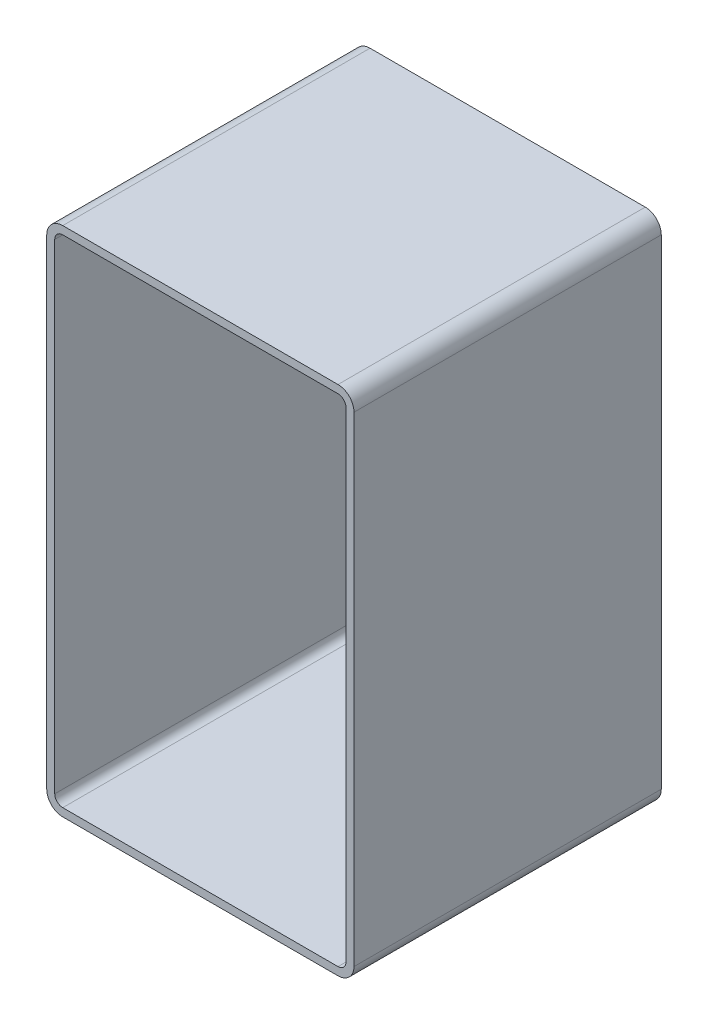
ISO-10303-21;
HEADER;
FILE_DESCRIPTION(('STEP AP214'),'2;1');
FILE_NAME('part.step','',(''),(''),'','','');
FILE_SCHEMA(('AUTOMOTIVE_DESIGN { 1 0 10303 214 1 1 1 1 }'));
ENDSEC;
DATA;
#1=APPLICATION_CONTEXT('core data for automotive mechanical design processes');
#2=APPLICATION_PROTOCOL_DEFINITION('international standard','automotive_design',2000,#1);
#3=PRODUCT_CONTEXT('',#1,'mechanical');
#4=PRODUCT('Part','Part','',(#3));
#5=PRODUCT_RELATED_PRODUCT_CATEGORY('part','',(#4));
#6=PRODUCT_DEFINITION_FORMATION('','',#4);
#7=PRODUCT_DEFINITION_CONTEXT('part definition',#1,'design');
#8=PRODUCT_DEFINITION('design','',#6,#7);
#9=PRODUCT_DEFINITION_SHAPE('','',#8);
#10=(LENGTH_UNIT() NAMED_UNIT(*) SI_UNIT(.MILLI.,.METRE.));
#11=(NAMED_UNIT(*) PLANE_ANGLE_UNIT() SI_UNIT($,.RADIAN.));
#12=(NAMED_UNIT(*) SI_UNIT($,.STERADIAN.) SOLID_ANGLE_UNIT());
#13=UNCERTAINTY_MEASURE_WITH_UNIT(LENGTH_MEASURE(1.E-05),#10,'distance_accuracy_value','');
#14=(GEOMETRIC_REPRESENTATION_CONTEXT(3) GLOBAL_UNCERTAINTY_ASSIGNED_CONTEXT((#13)) GLOBAL_UNIT_ASSIGNED_CONTEXT((#10,
#11,#12)) REPRESENTATION_CONTEXT('',''));
#15=CARTESIAN_POINT('',(0.,0.,0.));
#16=DIRECTION('',(0.,0.,1.));
#17=DIRECTION('',(1.,0.,0.));
#18=AXIS2_PLACEMENT_3D('',#15,#16,#17);
#19=CARTESIAN_POINT('',(16.9817030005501,493.816228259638,304.8));
#20=DIRECTION('',(0.,0.,1.));
#21=DIRECTION('',(1.,0.,0.));
#22=AXIS2_PLACEMENT_3D('',#19,#20,#21);
#23=PLANE('',#22);
#24=CARTESIAN_POINT('',(16.9817030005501,493.816228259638,304.8));
#25=DIRECTION('',(0.,0.,1.));
#26=DIRECTION('',(1.,0.,0.));
#27=AXIS2_PLACEMENT_3D('',#24,#25,#26);
#28=CIRCLE('',#27,15.875);
#29=CARTESIAN_POINT('',(16.9817030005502,509.691228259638,304.8));
#30=VERTEX_POINT('',#29);
#31=CARTESIAN_POINT('',(1.10670300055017,493.816228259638,304.8));
#32=VERTEX_POINT('',#31);
#33=EDGE_CURVE('E211',#30,#32,#28,.T.);
#34=ORIENTED_EDGE('',*,*,#33,.T.);
#35=DIRECTION('',(0.,-1.,0.));
#36=VECTOR('',#35,1.);
#37=CARTESIAN_POINT('',(1.10670300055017,17.5662282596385,304.8));
#38=LINE('',#37,#36);
#39=CARTESIAN_POINT('',(1.10670300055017,17.5662282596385,304.8));
#40=VERTEX_POINT('',#39);
#41=EDGE_CURVE('E214',#32,#40,#38,.T.);
#42=ORIENTED_EDGE('',*,*,#41,.T.);
#43=CARTESIAN_POINT('',(16.9817030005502,17.5662282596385,304.8));
#44=DIRECTION('',(0.,0.,1.));
#45=DIRECTION('',(1.,0.,0.));
#46=AXIS2_PLACEMENT_3D('',#43,#44,#45);
#47=CIRCLE('',#46,15.875);
#48=CARTESIAN_POINT('',(16.9817030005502,1.6912282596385,304.8));
#49=VERTEX_POINT('',#48);
#50=EDGE_CURVE('E217',#40,#49,#47,.T.);
#51=ORIENTED_EDGE('',*,*,#50,.T.);
#52=DIRECTION('',(1.,0.,0.));
#53=VECTOR('',#52,1.);
#54=CARTESIAN_POINT('',(290.03170300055,1.6912282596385,304.8));
#55=LINE('',#54,#53);
#56=CARTESIAN_POINT('',(290.03170300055,1.69122825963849,304.8));
#57=VERTEX_POINT('',#56);
#58=EDGE_CURVE('E219',#49,#57,#55,.T.);
#59=ORIENTED_EDGE('',*,*,#58,.T.);
#60=CARTESIAN_POINT('',(290.03170300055,17.5662282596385,304.8));
#61=DIRECTION('',(0.,0.,1.));
#62=DIRECTION('',(1.,0.,0.));
#63=AXIS2_PLACEMENT_3D('',#60,#61,#62);
#64=CIRCLE('',#63,15.875);
#65=CARTESIAN_POINT('',(305.90670300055,17.5662282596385,304.8));
#66=VERTEX_POINT('',#65);
#67=EDGE_CURVE('E221',#57,#66,#64,.T.);
#68=ORIENTED_EDGE('',*,*,#67,.T.);
#69=DIRECTION('',(0.,1.,0.));
#70=VECTOR('',#69,1.);
#71=CARTESIAN_POINT('',(305.90670300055,493.816228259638,304.8));
#72=LINE('',#71,#70);
#73=CARTESIAN_POINT('',(305.90670300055,493.816228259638,304.8));
#74=VERTEX_POINT('',#73);
#75=EDGE_CURVE('E223',#66,#74,#72,.T.);
#76=ORIENTED_EDGE('',*,*,#75,.T.);
#77=CARTESIAN_POINT('',(290.03170300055,493.816228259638,304.8));
#78=DIRECTION('',(0.,0.,1.));
#79=DIRECTION('',(1.,0.,0.));
#80=AXIS2_PLACEMENT_3D('',#77,#78,#79);
#81=CIRCLE('',#80,15.875);
#82=CARTESIAN_POINT('',(290.03170300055,509.691228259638,304.8));
#83=VERTEX_POINT('',#82);
#84=EDGE_CURVE('E225',#74,#83,#81,.T.);
#85=ORIENTED_EDGE('',*,*,#84,.T.);
#86=DIRECTION('',(-1.,0.,0.));
#87=VECTOR('',#86,1.);
#88=CARTESIAN_POINT('',(16.9817030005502,509.691228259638,304.8));
#89=LINE('',#88,#87);
#90=EDGE_CURVE('E227',#83,#30,#89,.T.);
#91=ORIENTED_EDGE('',*,*,#90,.T.);
#92=EDGE_LOOP('',(#34,#42,#51,#59,#68,#76,#85,#91));
#93=FACE_BOUND('',#92,.T.);
#94=DIRECTION('',(0.,-1.,0.));
#95=VECTOR('',#94,1.);
#96=CARTESIAN_POINT('',(9.04420300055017,17.5662282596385,304.8));
#97=LINE('',#96,#95);
#98=CARTESIAN_POINT('',(9.04420300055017,493.816228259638,304.8));
#99=VERTEX_POINT('',#98);
#100=CARTESIAN_POINT('',(9.04420300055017,17.5662282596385,304.8));
#101=VERTEX_POINT('',#100);
#102=EDGE_CURVE('E154',#99,#101,#97,.T.);
#103=ORIENTED_EDGE('',*,*,#102,.F.);
#104=CARTESIAN_POINT('',(16.9817030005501,493.816228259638,304.8));
#105=DIRECTION('',(0.,0.,1.));
#106=DIRECTION('',(1.,0.,0.));
#107=AXIS2_PLACEMENT_3D('',#104,#105,#106);
#108=CIRCLE('',#107,7.93750000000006);
#109=CARTESIAN_POINT('',(16.9817030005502,501.753728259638,304.8));
#110=VERTEX_POINT('',#109);
#111=EDGE_CURVE('E146',#110,#99,#108,.T.);
#112=ORIENTED_EDGE('',*,*,#111,.F.);
#113=DIRECTION('',(-1.,0.,0.));
#114=VECTOR('',#113,1.);
#115=CARTESIAN_POINT('',(16.9817030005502,501.753728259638,304.8));
#116=LINE('',#115,#114);
#117=CARTESIAN_POINT('',(290.03170300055,501.753728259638,304.8));
#118=VERTEX_POINT('',#117);
#119=EDGE_CURVE('E179',#118,#110,#116,.T.);
#120=ORIENTED_EDGE('',*,*,#119,.F.);
#121=CARTESIAN_POINT('',(290.03170300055,493.816228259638,304.8));
#122=DIRECTION('',(0.,0.,1.));
#123=DIRECTION('',(1.,0.,0.));
#124=AXIS2_PLACEMENT_3D('',#121,#122,#123);
#125=CIRCLE('',#124,7.93750000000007);
#126=CARTESIAN_POINT('',(297.96920300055,493.816228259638,304.8));
#127=VERTEX_POINT('',#126);
#128=EDGE_CURVE('E177',#127,#118,#125,.T.);
#129=ORIENTED_EDGE('',*,*,#128,.F.);
#130=DIRECTION('',(0.,1.,0.));
#131=VECTOR('',#130,1.);
#132=CARTESIAN_POINT('',(297.96920300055,493.816228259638,304.8));
#133=LINE('',#132,#131);
#134=CARTESIAN_POINT('',(297.96920300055,17.5662282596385,304.8));
#135=VERTEX_POINT('',#134);
#136=EDGE_CURVE('E175',#135,#127,#133,.T.);
#137=ORIENTED_EDGE('',*,*,#136,.F.);
#138=CARTESIAN_POINT('',(290.03170300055,17.5662282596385,304.8));
#139=DIRECTION('',(0.,0.,1.));
#140=DIRECTION('',(1.,0.,0.));
#141=AXIS2_PLACEMENT_3D('',#138,#139,#140);
#142=CIRCLE('',#141,7.93750000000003);
#143=CARTESIAN_POINT('',(290.03170300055,9.62872825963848,304.8));
#144=VERTEX_POINT('',#143);
#145=EDGE_CURVE('E173',#144,#135,#142,.T.);
#146=ORIENTED_EDGE('',*,*,#145,.F.);
#147=DIRECTION('',(1.,0.,0.));
#148=VECTOR('',#147,1.);
#149=CARTESIAN_POINT('',(290.03170300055,9.6287282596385,304.8));
#150=LINE('',#149,#148);
#151=CARTESIAN_POINT('',(16.9817030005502,9.6287282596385,304.8));
#152=VERTEX_POINT('',#151);
#153=EDGE_CURVE('E169',#152,#144,#150,.T.);
#154=ORIENTED_EDGE('',*,*,#153,.F.);
#155=CARTESIAN_POINT('',(16.9817030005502,17.5662282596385,304.8));
#156=DIRECTION('',(0.,0.,1.));
#157=DIRECTION('',(1.,0.,0.));
#158=AXIS2_PLACEMENT_3D('',#155,#156,#157);
#159=CIRCLE('',#158,7.9375);
#160=EDGE_CURVE('E167',#101,#152,#159,.T.);
#161=ORIENTED_EDGE('',*,*,#160,.F.);
#162=EDGE_LOOP('',(#103,#112,#120,#129,#137,#146,#154,#161));
#163=FACE_BOUND('',#162,.T.);
#164=ADVANCED_FACE('F33',(#93,#163),#23,.T.);
#165=CARTESIAN_POINT('',(16.9817030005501,493.816228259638,0.));
#166=DIRECTION('',(0.,0.,1.));
#167=DIRECTION('',(1.,0.,0.));
#168=AXIS2_PLACEMENT_3D('',#165,#166,#167);
#169=PLANE('',#168);
#170=CARTESIAN_POINT('',(16.9817030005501,493.816228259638,0.));
#171=DIRECTION('',(0.,0.,1.));
#172=DIRECTION('',(1.,0.,0.));
#173=AXIS2_PLACEMENT_3D('',#170,#171,#172);
#174=CIRCLE('',#173,15.875);
#175=CARTESIAN_POINT('',(16.9817030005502,509.691228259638,0.));
#176=VERTEX_POINT('',#175);
#177=CARTESIAN_POINT('',(1.10670300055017,493.816228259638,0.));
#178=VERTEX_POINT('',#177);
#179=EDGE_CURVE('E162',#176,#178,#174,.T.);
#180=ORIENTED_EDGE('',*,*,#179,.F.);
#181=DIRECTION('',(-1.,0.,0.));
#182=VECTOR('',#181,1.);
#183=CARTESIAN_POINT('',(16.9817030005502,509.691228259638,0.));
#184=LINE('',#183,#182);
#185=CARTESIAN_POINT('',(290.03170300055,509.691228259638,0.));
#186=VERTEX_POINT('',#185);
#187=EDGE_CURVE('E215',#186,#176,#184,.T.);
#188=ORIENTED_EDGE('',*,*,#187,.F.);
#189=CARTESIAN_POINT('',(290.03170300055,493.816228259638,0.));
#190=DIRECTION('',(0.,0.,1.));
#191=DIRECTION('',(1.,0.,0.));
#192=AXIS2_PLACEMENT_3D('',#189,#190,#191);
#193=CIRCLE('',#192,15.875);
#194=CARTESIAN_POINT('',(305.90670300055,493.816228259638,0.));
#195=VERTEX_POINT('',#194);
#196=EDGE_CURVE('E242',#195,#186,#193,.T.);
#197=ORIENTED_EDGE('',*,*,#196,.F.);
#198=DIRECTION('',(0.,1.,0.));
#199=VECTOR('',#198,1.);
#200=CARTESIAN_POINT('',(305.90670300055,493.816228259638,0.));
#201=LINE('',#200,#199);
#202=CARTESIAN_POINT('',(305.90670300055,17.5662282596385,0.));
#203=VERTEX_POINT('',#202);
#204=EDGE_CURVE('E240',#203,#195,#201,.T.);
#205=ORIENTED_EDGE('',*,*,#204,.F.);
#206=CARTESIAN_POINT('',(290.03170300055,17.5662282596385,0.));
#207=DIRECTION('',(0.,0.,1.));
#208=DIRECTION('',(1.,0.,0.));
#209=AXIS2_PLACEMENT_3D('',#206,#207,#208);
#210=CIRCLE('',#209,15.875);
#211=CARTESIAN_POINT('',(290.03170300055,1.69122825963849,0.));
#212=VERTEX_POINT('',#211);
#213=EDGE_CURVE('E238',#212,#203,#210,.T.);
#214=ORIENTED_EDGE('',*,*,#213,.F.);
#215=DIRECTION('',(1.,0.,0.));
#216=VECTOR('',#215,1.);
#217=CARTESIAN_POINT('',(290.03170300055,1.6912282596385,0.));
#218=LINE('',#217,#216);
#219=CARTESIAN_POINT('',(16.9817030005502,1.6912282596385,0.));
#220=VERTEX_POINT('',#219);
#221=EDGE_CURVE('E236',#220,#212,#218,.T.);
#222=ORIENTED_EDGE('',*,*,#221,.F.);
#223=CARTESIAN_POINT('',(16.9817030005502,17.5662282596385,0.));
#224=DIRECTION('',(0.,0.,1.));
#225=DIRECTION('',(1.,0.,0.));
#226=AXIS2_PLACEMENT_3D('',#223,#224,#225);
#227=CIRCLE('',#226,15.875);
#228=CARTESIAN_POINT('',(1.10670300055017,17.5662282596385,0.));
#229=VERTEX_POINT('',#228);
#230=EDGE_CURVE('E234',#229,#220,#227,.T.);
#231=ORIENTED_EDGE('',*,*,#230,.F.);
#232=DIRECTION('',(0.,-1.,0.));
#233=VECTOR('',#232,1.);
#234=CARTESIAN_POINT('',(1.10670300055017,17.5662282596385,0.));
#235=LINE('',#234,#233);
#236=EDGE_CURVE('E232',#178,#229,#235,.T.);
#237=ORIENTED_EDGE('',*,*,#236,.F.);
#238=EDGE_LOOP('',(#180,#188,#197,#205,#214,#222,#231,#237));
#239=FACE_BOUND('',#238,.T.);
#240=CARTESIAN_POINT('',(16.9817030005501,493.816228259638,0.));
#241=DIRECTION('',(0.,0.,1.));
#242=DIRECTION('',(1.,0.,0.));
#243=AXIS2_PLACEMENT_3D('',#240,#241,#242);
#244=CIRCLE('',#243,7.93750000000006);
#245=CARTESIAN_POINT('',(16.9817030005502,501.753728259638,0.));
#246=VERTEX_POINT('',#245);
#247=CARTESIAN_POINT('',(9.04420300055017,493.816228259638,0.));
#248=VERTEX_POINT('',#247);
#249=EDGE_CURVE('E56',#246,#248,#244,.T.);
#250=ORIENTED_EDGE('',*,*,#249,.T.);
#251=DIRECTION('',(0.,-1.,0.));
#252=VECTOR('',#251,1.);
#253=CARTESIAN_POINT('',(9.04420300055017,17.5662282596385,0.));
#254=LINE('',#253,#252);
#255=CARTESIAN_POINT('',(9.04420300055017,17.5662282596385,0.));
#256=VERTEX_POINT('',#255);
#257=EDGE_CURVE('E161',#248,#256,#254,.T.);
#258=ORIENTED_EDGE('',*,*,#257,.T.);
#259=CARTESIAN_POINT('',(16.9817030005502,17.5662282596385,0.));
#260=DIRECTION('',(0.,0.,1.));
#261=DIRECTION('',(1.,0.,0.));
#262=AXIS2_PLACEMENT_3D('',#259,#260,#261);
#263=CIRCLE('',#262,7.9375);
#264=CARTESIAN_POINT('',(16.9817030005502,9.6287282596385,0.));
#265=VERTEX_POINT('',#264);
#266=EDGE_CURVE('E183',#256,#265,#263,.T.);
#267=ORIENTED_EDGE('',*,*,#266,.T.);
#268=DIRECTION('',(1.,0.,0.));
#269=VECTOR('',#268,1.);
#270=CARTESIAN_POINT('',(290.03170300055,9.6287282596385,0.));
#271=LINE('',#270,#269);
#272=CARTESIAN_POINT('',(290.03170300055,9.62872825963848,0.));
#273=VERTEX_POINT('',#272);
#274=EDGE_CURVE('E186',#265,#273,#271,.T.);
#275=ORIENTED_EDGE('',*,*,#274,.T.);
#276=CARTESIAN_POINT('',(290.03170300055,17.5662282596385,0.));
#277=DIRECTION('',(0.,0.,1.));
#278=DIRECTION('',(1.,0.,0.));
#279=AXIS2_PLACEMENT_3D('',#276,#277,#278);
#280=CIRCLE('',#279,7.93750000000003);
#281=CARTESIAN_POINT('',(297.96920300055,17.5662282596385,0.));
#282=VERTEX_POINT('',#281);
#283=EDGE_CURVE('E189',#273,#282,#280,.T.);
#284=ORIENTED_EDGE('',*,*,#283,.T.);
#285=DIRECTION('',(0.,1.,0.));
#286=VECTOR('',#285,1.);
#287=CARTESIAN_POINT('',(297.96920300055,493.816228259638,0.));
#288=LINE('',#287,#286);
#289=CARTESIAN_POINT('',(297.96920300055,493.816228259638,0.));
#290=VERTEX_POINT('',#289);
#291=EDGE_CURVE('E192',#282,#290,#288,.T.);
#292=ORIENTED_EDGE('',*,*,#291,.T.);
#293=CARTESIAN_POINT('',(290.03170300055,493.816228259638,0.));
#294=DIRECTION('',(0.,0.,1.));
#295=DIRECTION('',(1.,0.,0.));
#296=AXIS2_PLACEMENT_3D('',#293,#294,#295);
#297=CIRCLE('',#296,7.93750000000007);
#298=CARTESIAN_POINT('',(290.03170300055,501.753728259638,0.));
#299=VERTEX_POINT('',#298);
#300=EDGE_CURVE('E195',#290,#299,#297,.T.);
#301=ORIENTED_EDGE('',*,*,#300,.T.);
#302=DIRECTION('',(-1.,0.,0.));
#303=VECTOR('',#302,1.);
#304=CARTESIAN_POINT('',(16.9817030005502,501.753728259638,0.));
#305=LINE('',#304,#303);
#306=EDGE_CURVE('E155',#299,#246,#305,.T.);
#307=ORIENTED_EDGE('',*,*,#306,.T.);
#308=EDGE_LOOP('',(#250,#258,#267,#275,#284,#292,#301,#307));
#309=FACE_BOUND('',#308,.T.);
#310=ADVANCED_FACE('F272',(#239,#309),#169,.F.);
#311=CARTESIAN_POINT('',(16.9817030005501,493.816228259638,304.8));
#312=DIRECTION('',(0.,0.,-1.));
#313=DIRECTION('',(-1.,0.,0.));
#314=AXIS2_PLACEMENT_3D('',#311,#312,#313);
#315=CYLINDRICAL_SURFACE('',#314,15.875);
#316=ORIENTED_EDGE('',*,*,#179,.T.);
#317=DIRECTION('',(0.,0.,-1.));
#318=VECTOR('',#317,1.);
#319=CARTESIAN_POINT('',(1.10670300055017,493.816228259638,304.8));
#320=LINE('',#319,#318);
#321=EDGE_CURVE('E11',#32,#178,#320,.T.);
#322=ORIENTED_EDGE('',*,*,#321,.F.);
#323=ORIENTED_EDGE('',*,*,#33,.F.);
#324=DIRECTION('',(0.,0.,-1.));
#325=VECTOR('',#324,1.);
#326=CARTESIAN_POINT('',(16.9817030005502,509.691228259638,304.8));
#327=LINE('',#326,#325);
#328=EDGE_CURVE('E229',#30,#176,#327,.T.);
#329=ORIENTED_EDGE('',*,*,#328,.T.);
#330=EDGE_LOOP('',(#316,#322,#323,#329));
#331=FACE_BOUND('',#330,.T.);
#332=ADVANCED_FACE('F35',(#331),#315,.T.);
#333=CARTESIAN_POINT('',(1.10670300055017,17.5662282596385,304.8));
#334=DIRECTION('',(1.,0.,0.));
#335=DIRECTION('',(0.,0.,-1.));
#336=AXIS2_PLACEMENT_3D('',#333,#334,#335);
#337=PLANE('',#336);
#338=ORIENTED_EDGE('',*,*,#236,.T.);
#339=DIRECTION('',(0.,0.,-1.));
#340=VECTOR('',#339,1.);
#341=CARTESIAN_POINT('',(1.10670300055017,17.5662282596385,304.8));
#342=LINE('',#341,#340);
#343=EDGE_CURVE('E41',#40,#229,#342,.T.);
#344=ORIENTED_EDGE('',*,*,#343,.F.);
#345=ORIENTED_EDGE('',*,*,#41,.F.);
#346=ORIENTED_EDGE('',*,*,#321,.T.);
#347=EDGE_LOOP('',(#338,#344,#345,#346));
#348=FACE_BOUND('',#347,.T.);
#349=ADVANCED_FACE('F289',(#348),#337,.F.);
#350=CARTESIAN_POINT('',(16.9817030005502,17.5662282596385,304.8));
#351=DIRECTION('',(0.,0.,-1.));
#352=DIRECTION('',(-1.,0.,0.));
#353=AXIS2_PLACEMENT_3D('',#350,#351,#352);
#354=CYLINDRICAL_SURFACE('',#353,15.875);
#355=ORIENTED_EDGE('',*,*,#230,.T.);
#356=DIRECTION('',(0.,0.,-1.));
#357=VECTOR('',#356,1.);
#358=CARTESIAN_POINT('',(16.9817030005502,1.6912282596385,304.8));
#359=LINE('',#358,#357);
#360=EDGE_CURVE('E259',#49,#220,#359,.T.);
#361=ORIENTED_EDGE('',*,*,#360,.F.);
#362=ORIENTED_EDGE('',*,*,#50,.F.);
#363=ORIENTED_EDGE('',*,*,#343,.T.);
#364=EDGE_LOOP('',(#355,#361,#362,#363));
#365=FACE_BOUND('',#364,.T.);
#366=ADVANCED_FACE('F266',(#365),#354,.T.);
#367=CARTESIAN_POINT('',(290.03170300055,1.6912282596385,304.8));
#368=DIRECTION('',(0.,1.,0.));
#369=DIRECTION('',(0.,0.,1.));
#370=AXIS2_PLACEMENT_3D('',#367,#368,#369);
#371=PLANE('',#370);
#372=ORIENTED_EDGE('',*,*,#221,.T.);
#373=DIRECTION('',(0.,0.,-1.));
#374=VECTOR('',#373,1.);
#375=CARTESIAN_POINT('',(290.03170300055,1.69122825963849,304.8));
#376=LINE('',#375,#374);
#377=EDGE_CURVE('E256',#57,#212,#376,.T.);
#378=ORIENTED_EDGE('',*,*,#377,.F.);
#379=ORIENTED_EDGE('',*,*,#58,.F.);
#380=ORIENTED_EDGE('',*,*,#360,.T.);
#381=EDGE_LOOP('',(#372,#378,#379,#380));
#382=FACE_BOUND('',#381,.T.);
#383=ADVANCED_FACE('F278',(#382),#371,.F.);
#384=CARTESIAN_POINT('',(290.03170300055,17.5662282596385,304.8));
#385=DIRECTION('',(0.,0.,-1.));
#386=DIRECTION('',(-1.,0.,0.));
#387=AXIS2_PLACEMENT_3D('',#384,#385,#386);
#388=CYLINDRICAL_SURFACE('',#387,15.875);
#389=ORIENTED_EDGE('',*,*,#213,.T.);
#390=DIRECTION('',(0.,0.,-1.));
#391=VECTOR('',#390,1.);
#392=CARTESIAN_POINT('',(305.90670300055,17.5662282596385,304.8));
#393=LINE('',#392,#391);
#394=EDGE_CURVE('E253',#66,#203,#393,.T.);
#395=ORIENTED_EDGE('',*,*,#394,.F.);
#396=ORIENTED_EDGE('',*,*,#67,.F.);
#397=ORIENTED_EDGE('',*,*,#377,.T.);
#398=EDGE_LOOP('',(#389,#395,#396,#397));
#399=FACE_BOUND('',#398,.T.);
#400=ADVANCED_FACE('F282',(#399),#388,.T.);
#401=CARTESIAN_POINT('',(305.90670300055,493.816228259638,304.8));
#402=DIRECTION('',(-1.,0.,0.));
#403=DIRECTION('',(0.,0.,1.));
#404=AXIS2_PLACEMENT_3D('',#401,#402,#403);
#405=PLANE('',#404);
#406=ORIENTED_EDGE('',*,*,#204,.T.);
#407=DIRECTION('',(0.,0.,-1.));
#408=VECTOR('',#407,1.);
#409=CARTESIAN_POINT('',(305.90670300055,493.816228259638,304.8));
#410=LINE('',#409,#408);
#411=EDGE_CURVE('E250',#74,#195,#410,.T.);
#412=ORIENTED_EDGE('',*,*,#411,.F.);
#413=ORIENTED_EDGE('',*,*,#75,.F.);
#414=ORIENTED_EDGE('',*,*,#394,.T.);
#415=EDGE_LOOP('',(#406,#412,#413,#414));
#416=FACE_BOUND('',#415,.T.);
#417=ADVANCED_FACE('F302',(#416),#405,.F.);
#418=CARTESIAN_POINT('',(290.03170300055,493.816228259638,304.8));
#419=DIRECTION('',(0.,0.,-1.));
#420=DIRECTION('',(-1.,0.,0.));
#421=AXIS2_PLACEMENT_3D('',#418,#419,#420);
#422=CYLINDRICAL_SURFACE('',#421,15.875);
#423=ORIENTED_EDGE('',*,*,#196,.T.);
#424=DIRECTION('',(0.,0.,-1.));
#425=VECTOR('',#424,1.);
#426=CARTESIAN_POINT('',(290.03170300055,509.691228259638,304.8));
#427=LINE('',#426,#425);
#428=EDGE_CURVE('E247',#83,#186,#427,.T.);
#429=ORIENTED_EDGE('',*,*,#428,.F.);
#430=ORIENTED_EDGE('',*,*,#84,.F.);
#431=ORIENTED_EDGE('',*,*,#411,.T.);
#432=EDGE_LOOP('',(#423,#429,#430,#431));
#433=FACE_BOUND('',#432,.T.);
#434=ADVANCED_FACE('F300',(#433),#422,.T.);
#435=CARTESIAN_POINT('',(16.9817030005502,509.691228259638,304.8));
#436=DIRECTION('',(0.,-1.,0.));
#437=DIRECTION('',(0.,0.,-1.));
#438=AXIS2_PLACEMENT_3D('',#435,#436,#437);
#439=PLANE('',#438);
#440=ORIENTED_EDGE('',*,*,#187,.T.);
#441=ORIENTED_EDGE('',*,*,#328,.F.);
#442=ORIENTED_EDGE('',*,*,#90,.F.);
#443=ORIENTED_EDGE('',*,*,#428,.T.);
#444=EDGE_LOOP('',(#440,#441,#442,#443));
#445=FACE_BOUND('',#444,.T.);
#446=ADVANCED_FACE('F295',(#445),#439,.F.);
#447=CARTESIAN_POINT('',(16.9817030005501,493.816228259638,304.8));
#448=DIRECTION('',(0.,0.,-1.));
#449=DIRECTION('',(-1.,0.,0.));
#450=AXIS2_PLACEMENT_3D('',#447,#448,#449);
#451=CYLINDRICAL_SURFACE('',#450,7.93750000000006);
#452=ORIENTED_EDGE('',*,*,#249,.F.);
#453=DIRECTION('',(0.,0.,-1.));
#454=VECTOR('',#453,1.);
#455=CARTESIAN_POINT('',(16.9817030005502,501.753728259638,304.8));
#456=LINE('',#455,#454);
#457=EDGE_CURVE('E150',#110,#246,#456,.T.);
#458=ORIENTED_EDGE('',*,*,#457,.F.);
#459=ORIENTED_EDGE('',*,*,#111,.T.);
#460=DIRECTION('',(0.,0.,-1.));
#461=VECTOR('',#460,1.);
#462=CARTESIAN_POINT('',(9.04420300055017,493.816228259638,304.8));
#463=LINE('',#462,#461);
#464=EDGE_CURVE('E149',#99,#248,#463,.T.);
#465=ORIENTED_EDGE('',*,*,#464,.T.);
#466=EDGE_LOOP('',(#452,#458,#459,#465));
#467=FACE_BOUND('',#466,.T.);
#468=ADVANCED_FACE('F148',(#467),#451,.F.);
#469=CARTESIAN_POINT('',(9.04420300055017,17.5662282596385,304.8));
#470=DIRECTION('',(1.,0.,0.));
#471=DIRECTION('',(0.,0.,-1.));
#472=AXIS2_PLACEMENT_3D('',#469,#470,#471);
#473=PLANE('',#472);
#474=ORIENTED_EDGE('',*,*,#257,.F.);
#475=ORIENTED_EDGE('',*,*,#464,.F.);
#476=ORIENTED_EDGE('',*,*,#102,.T.);
#477=DIRECTION('',(0.,0.,-1.));
#478=VECTOR('',#477,1.);
#479=CARTESIAN_POINT('',(9.04420300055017,17.5662282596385,304.8));
#480=LINE('',#479,#478);
#481=EDGE_CURVE('E163',#101,#256,#480,.T.);
#482=ORIENTED_EDGE('',*,*,#481,.T.);
#483=EDGE_LOOP('',(#474,#475,#476,#482));
#484=FACE_BOUND('',#483,.T.);
#485=ADVANCED_FACE('F158',(#484),#473,.T.);
#486=CARTESIAN_POINT('',(16.9817030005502,17.5662282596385,304.8));
#487=DIRECTION('',(0.,0.,-1.));
#488=DIRECTION('',(-1.,0.,0.));
#489=AXIS2_PLACEMENT_3D('',#486,#487,#488);
#490=CYLINDRICAL_SURFACE('',#489,7.9375);
#491=ORIENTED_EDGE('',*,*,#266,.F.);
#492=ORIENTED_EDGE('',*,*,#481,.F.);
#493=ORIENTED_EDGE('',*,*,#160,.T.);
#494=DIRECTION('',(0.,0.,-1.));
#495=VECTOR('',#494,1.);
#496=CARTESIAN_POINT('',(16.9817030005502,9.6287282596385,304.8));
#497=LINE('',#496,#495);
#498=EDGE_CURVE('E208',#152,#265,#497,.T.);
#499=ORIENTED_EDGE('',*,*,#498,.T.);
#500=EDGE_LOOP('',(#491,#492,#493,#499));
#501=FACE_BOUND('',#500,.T.);
#502=ADVANCED_FACE('F327',(#501),#490,.F.);
#503=CARTESIAN_POINT('',(290.03170300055,9.6287282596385,304.8));
#504=DIRECTION('',(0.,1.,0.));
#505=DIRECTION('',(0.,0.,1.));
#506=AXIS2_PLACEMENT_3D('',#503,#504,#505);
#507=PLANE('',#506);
#508=ORIENTED_EDGE('',*,*,#274,.F.);
#509=ORIENTED_EDGE('',*,*,#498,.F.);
#510=ORIENTED_EDGE('',*,*,#153,.T.);
#511=DIRECTION('',(0.,0.,-1.));
#512=VECTOR('',#511,1.);
#513=CARTESIAN_POINT('',(290.03170300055,9.62872825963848,304.8));
#514=LINE('',#513,#512);
#515=EDGE_CURVE('E206',#144,#273,#514,.T.);
#516=ORIENTED_EDGE('',*,*,#515,.T.);
#517=EDGE_LOOP('',(#508,#509,#510,#516));
#518=FACE_BOUND('',#517,.T.);
#519=ADVANCED_FACE('F331',(#518),#507,.T.);
#520=CARTESIAN_POINT('',(290.03170300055,17.5662282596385,304.8));
#521=DIRECTION('',(0.,0.,-1.));
#522=DIRECTION('',(-1.,0.,0.));
#523=AXIS2_PLACEMENT_3D('',#520,#521,#522);
#524=CYLINDRICAL_SURFACE('',#523,7.93750000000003);
#525=ORIENTED_EDGE('',*,*,#283,.F.);
#526=ORIENTED_EDGE('',*,*,#515,.F.);
#527=ORIENTED_EDGE('',*,*,#145,.T.);
#528=DIRECTION('',(0.,0.,-1.));
#529=VECTOR('',#528,1.);
#530=CARTESIAN_POINT('',(297.96920300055,17.5662282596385,304.8));
#531=LINE('',#530,#529);
#532=EDGE_CURVE('E204',#135,#282,#531,.T.);
#533=ORIENTED_EDGE('',*,*,#532,.T.);
#534=EDGE_LOOP('',(#525,#526,#527,#533));
#535=FACE_BOUND('',#534,.T.);
#536=ADVANCED_FACE('F337',(#535),#524,.F.);
#537=CARTESIAN_POINT('',(297.96920300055,493.816228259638,304.8));
#538=DIRECTION('',(-1.,0.,0.));
#539=DIRECTION('',(0.,0.,1.));
#540=AXIS2_PLACEMENT_3D('',#537,#538,#539);
#541=PLANE('',#540);
#542=ORIENTED_EDGE('',*,*,#291,.F.);
#543=ORIENTED_EDGE('',*,*,#532,.F.);
#544=ORIENTED_EDGE('',*,*,#136,.T.);
#545=DIRECTION('',(0.,0.,-1.));
#546=VECTOR('',#545,1.);
#547=CARTESIAN_POINT('',(297.96920300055,493.816228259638,304.8));
#548=LINE('',#547,#546);
#549=EDGE_CURVE('E202',#127,#290,#548,.T.);
#550=ORIENTED_EDGE('',*,*,#549,.T.);
#551=EDGE_LOOP('',(#542,#543,#544,#550));
#552=FACE_BOUND('',#551,.T.);
#553=ADVANCED_FACE('F341',(#552),#541,.T.);
#554=CARTESIAN_POINT('',(290.03170300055,493.816228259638,304.8));
#555=DIRECTION('',(0.,0.,-1.));
#556=DIRECTION('',(-1.,0.,0.));
#557=AXIS2_PLACEMENT_3D('',#554,#555,#556);
#558=CYLINDRICAL_SURFACE('',#557,7.93750000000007);
#559=ORIENTED_EDGE('',*,*,#300,.F.);
#560=ORIENTED_EDGE('',*,*,#549,.F.);
#561=ORIENTED_EDGE('',*,*,#128,.T.);
#562=DIRECTION('',(0.,0.,-1.));
#563=VECTOR('',#562,1.);
#564=CARTESIAN_POINT('',(290.03170300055,501.753728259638,304.8));
#565=LINE('',#564,#563);
#566=EDGE_CURVE('E48',#118,#299,#565,.T.);
#567=ORIENTED_EDGE('',*,*,#566,.T.);
#568=EDGE_LOOP('',(#559,#560,#561,#567));
#569=FACE_BOUND('',#568,.T.);
#570=ADVANCED_FACE('F345',(#569),#558,.F.);
#571=CARTESIAN_POINT('',(16.9817030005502,501.753728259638,304.8));
#572=DIRECTION('',(0.,-1.,0.));
#573=DIRECTION('',(0.,0.,-1.));
#574=AXIS2_PLACEMENT_3D('',#571,#572,#573);
#575=PLANE('',#574);
#576=ORIENTED_EDGE('',*,*,#306,.F.);
#577=ORIENTED_EDGE('',*,*,#566,.F.);
#578=ORIENTED_EDGE('',*,*,#119,.T.);
#579=ORIENTED_EDGE('',*,*,#457,.T.);
#580=EDGE_LOOP('',(#576,#577,#578,#579));
#581=FACE_BOUND('',#580,.T.);
#582=ADVANCED_FACE('F349',(#581),#575,.T.);
#583=CLOSED_SHELL('',(#164,#310,#332,#349,#366,#383,#400,#417,#434,#446,#468,#485,#502,#519,
#536,#553,#570,#582));
#584=MANIFOLD_SOLID_BREP('B2',#583);
#585=ADVANCED_BREP_SHAPE_REPRESENTATION('',(#18,#584),#14);
#586=SHAPE_DEFINITION_REPRESENTATION(#9,#585);
ENDSEC;
END-ISO-10303-21;
